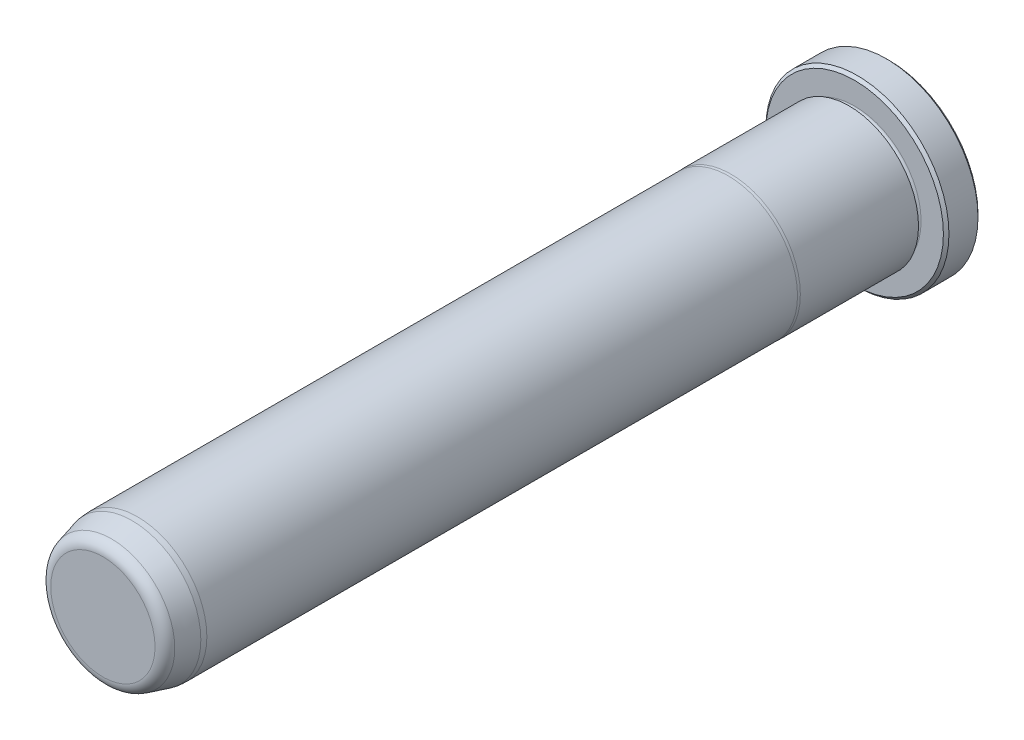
ISO-10303-21;
HEADER;
FILE_DESCRIPTION(('STEP AP214'),'2;1');
FILE_NAME('part.step','',(''),(''),'','','');
FILE_SCHEMA(('AUTOMOTIVE_DESIGN { 1 0 10303 214 1 1 1 1 }'));
ENDSEC;
DATA;
#1=APPLICATION_CONTEXT('core data for automotive mechanical design processes');
#2=APPLICATION_PROTOCOL_DEFINITION('international standard','automotive_design',2000,#1);
#3=PRODUCT_CONTEXT('',#1,'mechanical');
#4=PRODUCT('Part','Part','',(#3));
#5=PRODUCT_RELATED_PRODUCT_CATEGORY('part','',(#4));
#6=PRODUCT_DEFINITION_FORMATION('','',#4);
#7=PRODUCT_DEFINITION_CONTEXT('part definition',#1,'design');
#8=PRODUCT_DEFINITION('design','',#6,#7);
#9=PRODUCT_DEFINITION_SHAPE('','',#8);
#10=(LENGTH_UNIT() NAMED_UNIT(*) SI_UNIT(.MILLI.,.METRE.));
#11=(NAMED_UNIT(*) PLANE_ANGLE_UNIT() SI_UNIT($,.RADIAN.));
#12=(NAMED_UNIT(*) SI_UNIT($,.STERADIAN.) SOLID_ANGLE_UNIT());
#13=UNCERTAINTY_MEASURE_WITH_UNIT(LENGTH_MEASURE(1.E-05),#10,'distance_accuracy_value','');
#14=(GEOMETRIC_REPRESENTATION_CONTEXT(3) GLOBAL_UNCERTAINTY_ASSIGNED_CONTEXT((#13)) GLOBAL_UNIT_ASSIGNED_CONTEXT((#10,
#11,#12)) REPRESENTATION_CONTEXT('',''));
#15=CARTESIAN_POINT('',(0.,0.,0.));
#16=DIRECTION('',(0.,0.,1.));
#17=DIRECTION('',(1.,0.,0.));
#18=AXIS2_PLACEMENT_3D('',#15,#16,#17);
#19=CARTESIAN_POINT('',(0.,0.,0.));
#20=DIRECTION('',(0.,0.,1.));
#21=DIRECTION('',(1.,0.,0.));
#22=AXIS2_PLACEMENT_3D('',#19,#20,#21);
#23=PLANE('',#22);
#24=CARTESIAN_POINT('',(0.,0.,0.));
#25=DIRECTION('',(0.,0.,1.));
#26=DIRECTION('',(1.,0.,0.));
#27=AXIS2_PLACEMENT_3D('',#24,#25,#26);
#28=CIRCLE('',#27,12.192);
#29=CARTESIAN_POINT('',(12.192,0.,0.));
#30=VERTEX_POINT('',#29);
#31=EDGE_CURVE('E37',#30,#30,#28,.F.);
#32=ORIENTED_EDGE('',*,*,#31,.T.);
#33=EDGE_LOOP('',(#32));
#34=FACE_BOUND('',#33,.T.);
#35=ADVANCED_FACE('F30',(#34),#23,.F.);
#36=CARTESIAN_POINT('',(0.,0.,0.));
#37=DIRECTION('',(0.,0.,1.));
#38=DIRECTION('',(1.,0.,0.));
#39=AXIS2_PLACEMENT_3D('',#36,#37,#38);
#40=CYLINDRICAL_SURFACE('',#39,12.573);
#41=CARTESIAN_POINT('',(0.,0.,0.380999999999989));
#42=DIRECTION('',(0.,0.,1.));
#43=DIRECTION('',(1.,0.,0.));
#44=AXIS2_PLACEMENT_3D('',#41,#42,#43);
#45=CIRCLE('',#44,12.573);
#46=CARTESIAN_POINT('',(12.573,0.,0.380999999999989));
#47=VERTEX_POINT('',#46);
#48=EDGE_CURVE('E41',#47,#47,#45,.T.);
#49=ORIENTED_EDGE('',*,*,#48,.T.);
#50=EDGE_LOOP('',(#49));
#51=FACE_BOUND('',#50,.T.);
#52=CARTESIAN_POINT('',(0.,0.,4.36879999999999));
#53=DIRECTION('',(0.,0.,-1.));
#54=DIRECTION('',(-1.,0.,0.));
#55=AXIS2_PLACEMENT_3D('',#52,#53,#54);
#56=CIRCLE('',#55,12.573);
#57=CARTESIAN_POINT('',(-12.573,0.,4.36879999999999));
#58=VERTEX_POINT('',#57);
#59=EDGE_CURVE('E45',#58,#58,#56,.T.);
#60=ORIENTED_EDGE('',*,*,#59,.T.);
#61=EDGE_LOOP('',(#60));
#62=FACE_BOUND('',#61,.T.);
#63=ADVANCED_FACE('F118',(#51,#62),#40,.T.);
#64=CARTESIAN_POINT('',(0.,12.573,4.7498));
#65=DIRECTION('',(0.,0.,-1.));
#66=DIRECTION('',(-1.,0.,0.));
#67=AXIS2_PLACEMENT_3D('',#64,#65,#66);
#68=PLANE('',#67);
#69=CARTESIAN_POINT('',(0.,0.,4.7498));
#70=DIRECTION('',(0.,0.,-1.));
#71=DIRECTION('',(-1.,0.,0.));
#72=AXIS2_PLACEMENT_3D('',#69,#70,#71);
#73=CIRCLE('',#72,12.192);
#74=CARTESIAN_POINT('',(-12.192,0.,4.7498));
#75=VERTEX_POINT('',#74);
#76=EDGE_CURVE('E10',#75,#75,#73,.F.);
#77=ORIENTED_EDGE('',*,*,#76,.T.);
#78=EDGE_LOOP('',(#77));
#79=FACE_BOUND('',#78,.T.);
#80=CARTESIAN_POINT('',(0.,0.,4.7498));
#81=DIRECTION('',(0.,0.,1.));
#82=DIRECTION('',(1.,0.,0.));
#83=AXIS2_PLACEMENT_3D('',#80,#81,#82);
#84=CIRCLE('',#83,9.1313);
#85=CARTESIAN_POINT('',(9.1313,0.,4.7498));
#86=VERTEX_POINT('',#85);
#87=EDGE_CURVE('E56',#86,#86,#84,.T.);
#88=ORIENTED_EDGE('',*,*,#87,.F.);
#89=EDGE_LOOP('',(#88));
#90=FACE_BOUND('',#89,.T.);
#91=ADVANCED_FACE('F113',(#79,#90),#68,.F.);
#92=CARTESIAN_POINT('',(0.,0.,5.1308));
#93=DIRECTION('',(0.,0.,1.));
#94=DIRECTION('',(1.,0.,0.));
#95=AXIS2_PLACEMENT_3D('',#92,#93,#94);
#96=TOROIDAL_SURFACE('',#95,9.1313,0.381);
#97=CARTESIAN_POINT('',(0.,0.,5.5118));
#98=DIRECTION('',(0.,0.,1.));
#99=DIRECTION('',(1.,0.,0.));
#100=AXIS2_PLACEMENT_3D('',#97,#98,#99);
#101=CIRCLE('',#100,9.1313);
#102=CARTESIAN_POINT('',(9.1313,0.,5.5118));
#103=VERTEX_POINT('',#102);
#104=EDGE_CURVE('E59',#103,#103,#101,.T.);
#105=ORIENTED_EDGE('',*,*,#104,.F.);
#106=EDGE_LOOP('',(#105));
#107=FACE_BOUND('',#106,.T.);
#108=ORIENTED_EDGE('',*,*,#87,.T.);
#109=EDGE_LOOP('',(#108));
#110=FACE_BOUND('',#109,.T.);
#111=ADVANCED_FACE('F107',(#107,#110),#96,.F.);
#112=CARTESIAN_POINT('',(0.,9.1313,5.5118));
#113=DIRECTION('',(0.,0.,1.));
#114=DIRECTION('',(1.,0.,0.));
#115=AXIS2_PLACEMENT_3D('',#112,#113,#114);
#116=PLANE('',#115);
#117=CARTESIAN_POINT('',(0.,0.,5.5118));
#118=DIRECTION('',(0.,0.,1.));
#119=DIRECTION('',(1.,0.,0.));
#120=AXIS2_PLACEMENT_3D('',#117,#118,#119);
#121=CIRCLE('',#120,9.5377);
#122=CARTESIAN_POINT('',(9.5377,0.,5.5118));
#123=VERTEX_POINT('',#122);
#124=EDGE_CURVE('E62',#123,#123,#121,.T.);
#125=ORIENTED_EDGE('',*,*,#124,.F.);
#126=EDGE_LOOP('',(#125));
#127=FACE_BOUND('',#126,.T.);
#128=ORIENTED_EDGE('',*,*,#104,.T.);
#129=EDGE_LOOP('',(#128));
#130=FACE_BOUND('',#129,.T.);
#131=ADVANCED_FACE('F101',(#127,#130),#116,.F.);
#132=CARTESIAN_POINT('',(0.,0.,0.));
#133=DIRECTION('',(0.,0.,1.));
#134=DIRECTION('',(1.,0.,0.));
#135=AXIS2_PLACEMENT_3D('',#132,#133,#134);
#136=CYLINDRICAL_SURFACE('',#135,9.5377);
#137=CARTESIAN_POINT('',(0.,0.,21.7347630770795));
#138=DIRECTION('',(0.,0.,1.));
#139=DIRECTION('',(1.,0.,0.));
#140=AXIS2_PLACEMENT_3D('',#137,#138,#139);
#141=CIRCLE('',#140,9.5377);
#142=CARTESIAN_POINT('',(9.5377,0.,21.7347630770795));
#143=VERTEX_POINT('',#142);
#144=EDGE_CURVE('E65',#143,#143,#141,.T.);
#145=ORIENTED_EDGE('',*,*,#144,.F.);
#146=EDGE_LOOP('',(#145));
#147=FACE_BOUND('',#146,.T.);
#148=ORIENTED_EDGE('',*,*,#124,.T.);
#149=EDGE_LOOP('',(#148));
#150=FACE_BOUND('',#149,.T.);
#151=ADVANCED_FACE('F95',(#147,#150),#136,.T.);
#152=CARTESIAN_POINT('',(0.,0.,21.7347630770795));
#153=DIRECTION('',(0.,0.,-1.));
#154=DIRECTION('',(-1.,0.,0.));
#155=AXIS2_PLACEMENT_3D('',#152,#153,#154);
#156=CONICAL_SURFACE('',#155,9.5377,0.069813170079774);
#157=CARTESIAN_POINT('',(0.,0.,22.098));
#158=DIRECTION('',(0.,0.,1.));
#159=DIRECTION('',(1.,0.,0.));
#160=AXIS2_PLACEMENT_3D('',#157,#158,#159);
#161=CIRCLE('',#160,9.5123);
#162=CARTESIAN_POINT('',(9.5123,0.,22.098));
#163=VERTEX_POINT('',#162);
#164=EDGE_CURVE('E68',#163,#163,#161,.T.);
#165=ORIENTED_EDGE('',*,*,#164,.F.);
#166=EDGE_LOOP('',(#165));
#167=FACE_BOUND('',#166,.T.);
#168=ORIENTED_EDGE('',*,*,#144,.T.);
#169=EDGE_LOOP('',(#168));
#170=FACE_BOUND('',#169,.T.);
#171=ADVANCED_FACE('F89',(#167,#170),#156,.T.);
#172=CARTESIAN_POINT('',(0.,0.,0.));
#173=DIRECTION('',(0.,0.,1.));
#174=DIRECTION('',(1.,0.,0.));
#175=AXIS2_PLACEMENT_3D('',#172,#173,#174);
#176=CYLINDRICAL_SURFACE('',#175,9.51229999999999);
#177=CARTESIAN_POINT('',(0.,0.,103.1875));
#178=DIRECTION('',(0.,0.,1.));
#179=DIRECTION('',(1.,0.,0.));
#180=AXIS2_PLACEMENT_3D('',#177,#178,#179);
#181=CIRCLE('',#180,9.51229999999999);
#182=CARTESIAN_POINT('',(9.51229999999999,0.,103.1875));
#183=VERTEX_POINT('',#182);
#184=EDGE_CURVE('E71',#183,#183,#181,.T.);
#185=ORIENTED_EDGE('',*,*,#184,.F.);
#186=EDGE_LOOP('',(#185));
#187=FACE_BOUND('',#186,.T.);
#188=ORIENTED_EDGE('',*,*,#164,.T.);
#189=EDGE_LOOP('',(#188));
#190=FACE_BOUND('',#189,.T.);
#191=ADVANCED_FACE('F83',(#187,#190),#176,.T.);
#192=CARTESIAN_POINT('',(0.,0.,103.1875));
#193=DIRECTION('',(0.,0.,-1.));
#194=DIRECTION('',(-1.,0.,0.));
#195=AXIS2_PLACEMENT_3D('',#192,#193,#194);
#196=CONICAL_SURFACE('',#195,9.51229999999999,0.0872664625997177);
#197=CARTESIAN_POINT('',(0.,0.,103.9495));
#198=DIRECTION('',(0.,0.,1.));
#199=DIRECTION('',(1.,0.,0.));
#200=AXIS2_PLACEMENT_3D('',#197,#198,#199);
#201=CIRCLE('',#200,9.44563363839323);
#202=CARTESIAN_POINT('',(9.44563363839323,0.,103.9495));
#203=VERTEX_POINT('',#202);
#204=EDGE_CURVE('E74',#203,#203,#201,.T.);
#205=ORIENTED_EDGE('',*,*,#204,.F.);
#206=EDGE_LOOP('',(#205));
#207=FACE_BOUND('',#206,.T.);
#208=ORIENTED_EDGE('',*,*,#184,.T.);
#209=EDGE_LOOP('',(#208));
#210=FACE_BOUND('',#209,.T.);
#211=ADVANCED_FACE('F80',(#207,#210),#196,.T.);
#212=CARTESIAN_POINT('',(0.,0.,103.9495));
#213=DIRECTION('',(0.,0.,-1.));
#214=DIRECTION('',(-1.,0.,0.));
#215=AXIS2_PLACEMENT_3D('',#212,#213,#214);
#216=CONICAL_SURFACE('',#215,9.44563363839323,0.26179938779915);
#217=CARTESIAN_POINT('',(0.,0.,106.7733752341));
#218=DIRECTION('',(0.,0.,1.));
#219=DIRECTION('',(1.,0.,0.));
#220=AXIS2_PLACEMENT_3D('',#217,#218,#219);
#221=CIRCLE('',#220,8.68897854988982);
#222=CARTESIAN_POINT('',(8.68897854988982,0.,106.7733752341));
#223=VERTEX_POINT('',#222);
#224=EDGE_CURVE('E50',#223,#223,#221,.F.);
#225=ORIENTED_EDGE('',*,*,#224,.T.);
#226=EDGE_LOOP('',(#225));
#227=FACE_BOUND('',#226,.T.);
#228=ORIENTED_EDGE('',*,*,#204,.T.);
#229=EDGE_LOOP('',(#228));
#230=FACE_BOUND('',#229,.T.);
#231=ADVANCED_FACE('F78',(#227,#230),#216,.T.);
#232=CARTESIAN_POINT('',(0.,8.37370289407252,107.95));
#233=DIRECTION('',(0.,0.,-1.));
#234=DIRECTION('',(-1.,0.,0.));
#235=AXIS2_PLACEMENT_3D('',#232,#233,#234);
#236=PLANE('',#235);
#237=CARTESIAN_POINT('',(0.,0.,107.95));
#238=DIRECTION('',(0.,0.,-1.));
#239=DIRECTION('',(-1.,0.,0.));
#240=AXIS2_PLACEMENT_3D('',#237,#238,#239);
#241=CIRCLE('',#240,7.15557130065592);
#242=CARTESIAN_POINT('',(-7.15557130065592,0.,107.95));
#243=VERTEX_POINT('',#242);
#244=EDGE_CURVE('E53',#243,#243,#241,.F.);
#245=ORIENTED_EDGE('',*,*,#244,.T.);
#246=EDGE_LOOP('',(#245));
#247=FACE_BOUND('',#246,.T.);
#248=ADVANCED_FACE('F133',(#247),#236,.F.);
#249=CARTESIAN_POINT('',(0.,0.,106.3625));
#250=DIRECTION('',(0.,0.,-1.));
#251=DIRECTION('',(-1.,0.,0.));
#252=AXIS2_PLACEMENT_3D('',#249,#250,#251);
#253=TOROIDAL_SURFACE('',#252,7.15557130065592,1.5875);
#254=ORIENTED_EDGE('',*,*,#224,.F.);
#255=EDGE_LOOP('',(#254));
#256=FACE_BOUND('',#255,.T.);
#257=ORIENTED_EDGE('',*,*,#244,.F.);
#258=EDGE_LOOP('',(#257));
#259=FACE_BOUND('',#258,.T.);
#260=ADVANCED_FACE('F130',(#256,#259),#253,.T.);
#261=CARTESIAN_POINT('',(0.,0.,0.380999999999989));
#262=DIRECTION('',(0.,0.,1.));
#263=DIRECTION('',(1.,0.,0.));
#264=AXIS2_PLACEMENT_3D('',#261,#262,#263);
#265=CONICAL_SURFACE('',#264,12.573,0.785398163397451);
#266=ORIENTED_EDGE('',*,*,#31,.F.);
#267=EDGE_LOOP('',(#266));
#268=FACE_BOUND('',#267,.T.);
#269=ORIENTED_EDGE('',*,*,#48,.F.);
#270=EDGE_LOOP('',(#269));
#271=FACE_BOUND('',#270,.T.);
#272=ADVANCED_FACE('F132',(#268,#271),#265,.T.);
#273=CARTESIAN_POINT('',(0.,0.,4.7498));
#274=DIRECTION('',(0.,0.,-1.));
#275=DIRECTION('',(-1.,0.,0.));
#276=AXIS2_PLACEMENT_3D('',#273,#274,#275);
#277=CONICAL_SURFACE('',#276,12.192,0.785398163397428);
#278=CARTESIAN_POINT('',(-12.573,0.,4.36879999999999));
#279=CARTESIAN_POINT('',(-12.56903125,0.,4.37276874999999));
#280=CARTESIAN_POINT('',(-12.5650625,0.,4.37673749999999));
#281=CARTESIAN_POINT('',(-12.557125,0.,4.38467499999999));
#282=CARTESIAN_POINT('',(-12.55315625,0.,4.38864374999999));
#283=CARTESIAN_POINT('',(-12.54521875,0.,4.39658124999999));
#284=CARTESIAN_POINT('',(-12.54125,0.,4.40054999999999));
#285=CARTESIAN_POINT('',(-12.5333125,0.,4.40848749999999));
#286=CARTESIAN_POINT('',(-12.52934375,0.,4.41245624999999));
#287=CARTESIAN_POINT('',(-12.52140625,0.,4.42039374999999));
#288=CARTESIAN_POINT('',(-12.5174375,0.,4.42436249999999));
#289=CARTESIAN_POINT('',(-12.5095,0.,4.43229999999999));
#290=CARTESIAN_POINT('',(-12.50553125,0.,4.43626874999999));
#291=CARTESIAN_POINT('',(-12.49759375,0.,4.44420624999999));
#292=CARTESIAN_POINT('',(-12.493625,0.,4.448175));
#293=CARTESIAN_POINT('',(-12.4856875,0.,4.4561125));
#294=CARTESIAN_POINT('',(-12.48171875,0.,4.46008124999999));
#295=CARTESIAN_POINT('',(-12.47378125,0.,4.46801874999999));
#296=CARTESIAN_POINT('',(-12.4698125,0.,4.4719875));
#297=CARTESIAN_POINT('',(-12.461875,0.,4.479925));
#298=CARTESIAN_POINT('',(-12.45790625,0.,4.48389374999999));
#299=CARTESIAN_POINT('',(-12.44996875,0.,4.49183124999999));
#300=CARTESIAN_POINT('',(-12.446,0.,4.4958));
#301=CARTESIAN_POINT('',(-12.4380625,0.,4.5037375));
#302=CARTESIAN_POINT('',(-12.43409375,0.,4.50770624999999));
#303=CARTESIAN_POINT('',(-12.42615625,0.,4.51564375));
#304=CARTESIAN_POINT('',(-12.4221875,0.,4.5196125));
#305=CARTESIAN_POINT('',(-12.41425,0.,4.52755));
#306=CARTESIAN_POINT('',(-12.41028125,0.,4.53151875));
#307=CARTESIAN_POINT('',(-12.40234375,0.,4.53945625));
#308=CARTESIAN_POINT('',(-12.398375,0.,4.543425));
#309=CARTESIAN_POINT('',(-12.3904375,0.,4.5513625));
#310=CARTESIAN_POINT('',(-12.38646875,0.,4.55533125));
#311=CARTESIAN_POINT('',(-12.37853125,0.,4.56326875));
#312=CARTESIAN_POINT('',(-12.3745625,0.,4.5672375));
#313=CARTESIAN_POINT('',(-12.366625,0.,4.575175));
#314=CARTESIAN_POINT('',(-12.36265625,0.,4.57914375));
#315=CARTESIAN_POINT('',(-12.35471875,0.,4.58708125));
#316=CARTESIAN_POINT('',(-12.35075,0.,4.59105));
#317=CARTESIAN_POINT('',(-12.3428125,0.,4.5989875));
#318=CARTESIAN_POINT('',(-12.33884375,0.,4.60295625));
#319=CARTESIAN_POINT('',(-12.33090625,0.,4.61089375));
#320=CARTESIAN_POINT('',(-12.3269375,0.,4.6148625));
#321=CARTESIAN_POINT('',(-12.319,0.,4.6228));
#322=CARTESIAN_POINT('',(-12.31503125,0.,4.62676875));
#323=CARTESIAN_POINT('',(-12.30709375,0.,4.63470625));
#324=CARTESIAN_POINT('',(-12.303125,0.,4.638675));
#325=CARTESIAN_POINT('',(-12.2951875,0.,4.6466125));
#326=CARTESIAN_POINT('',(-12.29121875,0.,4.65058125));
#327=CARTESIAN_POINT('',(-12.28328125,0.,4.65851875));
#328=CARTESIAN_POINT('',(-12.2793125,0.,4.6624875));
#329=CARTESIAN_POINT('',(-12.271375,0.,4.670425));
#330=CARTESIAN_POINT('',(-12.26740625,0.,4.67439375));
#331=CARTESIAN_POINT('',(-12.25946875,0.,4.68233125));
#332=CARTESIAN_POINT('',(-12.2555,0.,4.6863));
#333=CARTESIAN_POINT('',(-12.2475625,0.,4.6942375));
#334=CARTESIAN_POINT('',(-12.24359375,0.,4.69820625));
#335=CARTESIAN_POINT('',(-12.23565625,0.,4.70614375));
#336=CARTESIAN_POINT('',(-12.2316875,0.,4.7101125));
#337=CARTESIAN_POINT('',(-12.22375,0.,4.71805));
#338=CARTESIAN_POINT('',(-12.21978125,0.,4.72201875));
#339=CARTESIAN_POINT('',(-12.21184375,0.,4.72995625));
#340=CARTESIAN_POINT('',(-12.207875,0.,4.733925));
#341=CARTESIAN_POINT('',(-12.1999375,0.,4.7418625));
#342=CARTESIAN_POINT('',(-12.19596875,0.,4.74583125));
#343=CARTESIAN_POINT('',(-12.192,0.,4.7498));
#344=B_SPLINE_CURVE_WITH_KNOTS('',3,(#278,#279,#280,#281,#282,#283,#284,#285,#286,#287,#288,
#289,#290,#291,#292,#293,#294,#295,#296,#297,#298,#299,#300,#301,#302,#303,#304,#305,#306,#307,
#308,#309,#310,#311,#312,#313,#314,#315,#316,#317,#318,#319,#320,#321,#322,#323,#324,#325,#326,
#327,#328,#329,#330,#331,#332,#333,#334,#335,#336,#337,#338,#339,#340,#341,#342,#343),
.UNSPECIFIED.,.F.,.F.,(4,2,2,2,2,2,2,2,2,2,2,2,2,2,2,2,2,2,2,2,2,2,2,2,2,2,2,2,2,2,2,2,4),(0.,
0.0168379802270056,0.0336759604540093,0.0505139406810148,0.0673519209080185,0.0841899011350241,
0.101027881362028,0.117865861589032,0.134703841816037,0.151541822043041,0.168379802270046,
0.185217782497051,0.202055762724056,0.21889374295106,0.235731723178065,0.252569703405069,
0.269407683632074,0.286245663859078,0.303083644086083,0.319921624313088,0.336759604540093,
0.353597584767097,0.370435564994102,0.387273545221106,0.404111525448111,0.420949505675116,
0.43778748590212,0.454625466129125,0.471463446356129,0.488301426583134,0.505139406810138,
0.521977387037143,0.538815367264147),.UNSPECIFIED.);
#345=EDGE_CURVE('BSEAM32',#58,#75,#344,.T.);
#346=ORIENTED_EDGE('',*,*,#59,.F.);
#347=ORIENTED_EDGE('',*,*,#76,.F.);
#348=ORIENTED_EDGE('',*,*,#345,.T.);
#349=ORIENTED_EDGE('',*,*,#345,.F.);
#350=EDGE_LOOP('',(#346,#348,#347,#349));
#351=FACE_BOUND('',#350,.T.);
#352=ADVANCED_FACE('F32',(#351),#277,.T.);
#353=CLOSED_SHELL('',(#35,#63,#91,#111,#131,#151,#171,#191,#211,#231,#248,#260,#272,#352));
#354=MANIFOLD_SOLID_BREP('B2',#353);
#355=ADVANCED_BREP_SHAPE_REPRESENTATION('',(#18,#354),#14);
#356=SHAPE_DEFINITION_REPRESENTATION(#9,#355);
ENDSEC;
END-ISO-10303-21;
